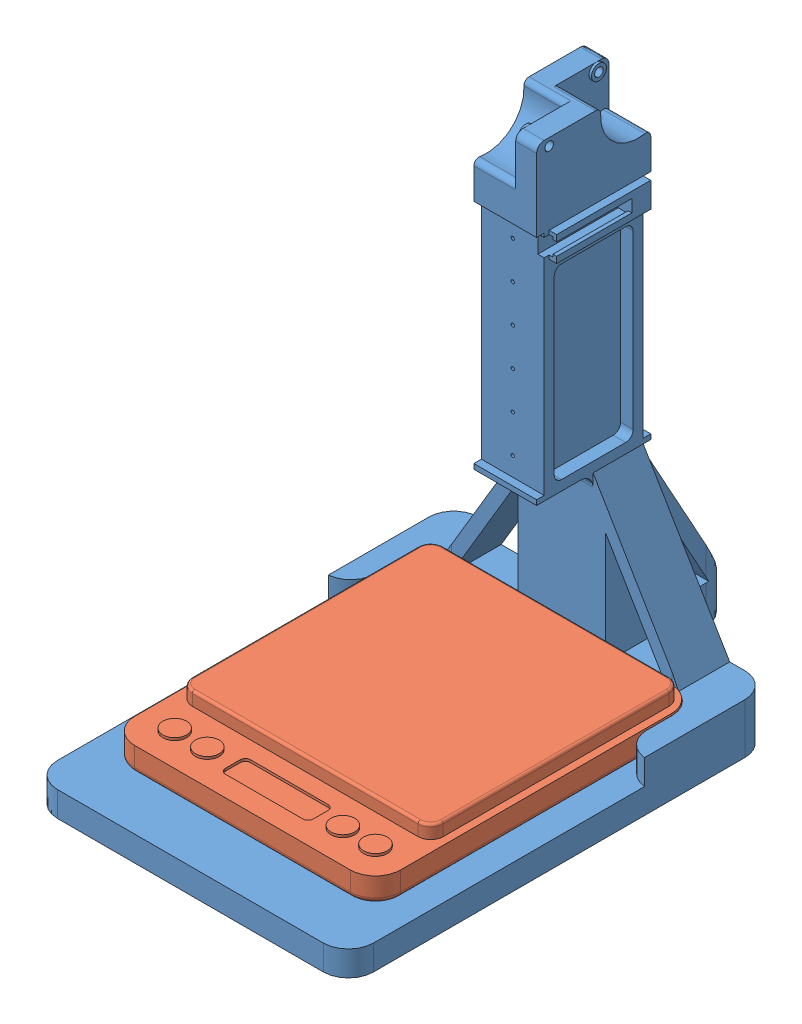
SolidWorks assembly gravity base and scale assembly.SLDASM, configuration Default (file format 10000). Lengths in mm.
Overall size (126 202.5 205.5).
2 component instances, 2 part files, 2 mates.
Components (placement in the parent):
- burn device base-1: burn device base.SLDPRT [Default] at (40.3293 18.6124 113.1783) size (126 202.5 205.5)
- Scale-1: Scale.SLDPRT [Default] at (-11.8929 18.6124 193.6883) size (106.2 16.1 128.2)
Mates (geometry in assembly coordinates):
- Coincident1: coincident anti-aligned: plane of burn device base-1 through (52.8293 18.6124 65.6883) normal (0 1 0); plane of Scale-1 through (-11.8929 18.6124 193.6883) normal (0 -1 0)
- Coincident2: coincident anti-aligned: plane of burn device base-1 through (52.8293 88.6124 65.6883) normal (0 0 1); plane of Scale-1 through (-11.8929 29.2124 65.6883) normal (0 0 -1)
